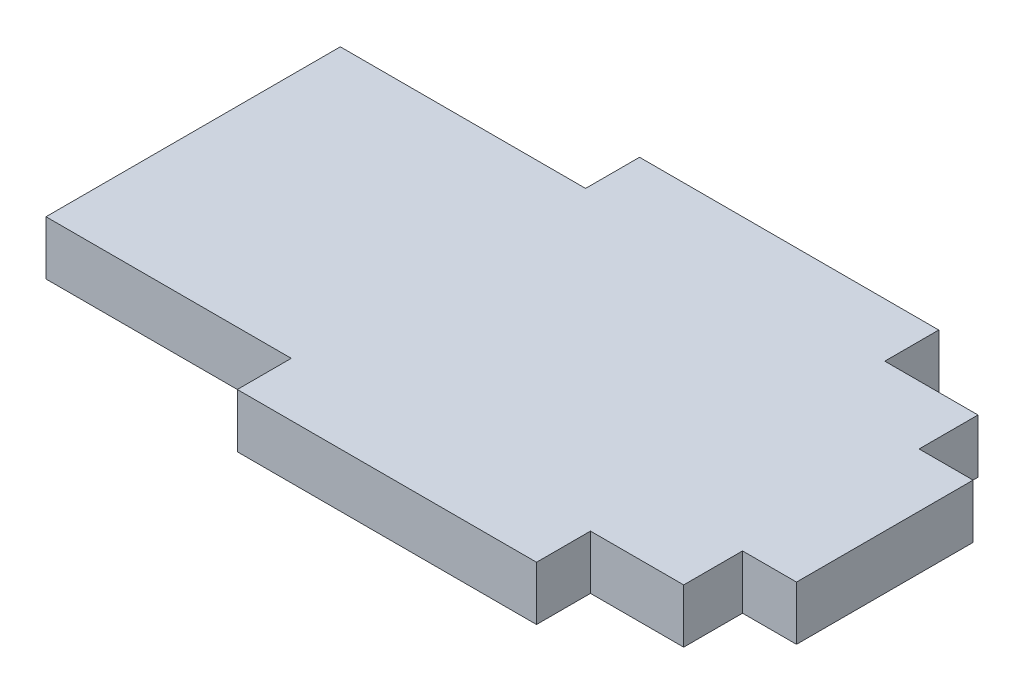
ISO-10303-21;
HEADER;
FILE_DESCRIPTION(('STEP AP214'),'2;1');
FILE_NAME('part.step','',(''),(''),'','','');
FILE_SCHEMA(('AUTOMOTIVE_DESIGN { 1 0 10303 214 1 1 1 1 }'));
ENDSEC;
DATA;
#1=APPLICATION_CONTEXT('core data for automotive mechanical design processes');
#2=APPLICATION_PROTOCOL_DEFINITION('international standard','automotive_design',2000,#1);
#3=PRODUCT_CONTEXT('',#1,'mechanical');
#4=PRODUCT('Part','Part','',(#3));
#5=PRODUCT_RELATED_PRODUCT_CATEGORY('part','',(#4));
#6=PRODUCT_DEFINITION_FORMATION('','',#4);
#7=PRODUCT_DEFINITION_CONTEXT('part definition',#1,'design');
#8=PRODUCT_DEFINITION('design','',#6,#7);
#9=PRODUCT_DEFINITION_SHAPE('','',#8);
#10=(LENGTH_UNIT() NAMED_UNIT(*) SI_UNIT(.MILLI.,.METRE.));
#11=(NAMED_UNIT(*) PLANE_ANGLE_UNIT() SI_UNIT($,.RADIAN.));
#12=(NAMED_UNIT(*) SI_UNIT($,.STERADIAN.) SOLID_ANGLE_UNIT());
#13=UNCERTAINTY_MEASURE_WITH_UNIT(LENGTH_MEASURE(1.E-05),#10,'distance_accuracy_value','');
#14=(GEOMETRIC_REPRESENTATION_CONTEXT(3) GLOBAL_UNCERTAINTY_ASSIGNED_CONTEXT((#13)) GLOBAL_UNIT_ASSIGNED_CONTEXT((#10,
#11,#12)) REPRESENTATION_CONTEXT('',''));
#15=CARTESIAN_POINT('',(0.,0.,0.));
#16=DIRECTION('',(0.,0.,1.));
#17=DIRECTION('',(1.,0.,0.));
#18=AXIS2_PLACEMENT_3D('',#15,#16,#17);
#19=CARTESIAN_POINT('',(-7.5,5.5,15.));
#20=DIRECTION('',(0.,0.,-1.));
#21=DIRECTION('',(-1.,0.,0.));
#22=AXIS2_PLACEMENT_3D('',#19,#20,#21);
#23=PLANE('',#22);
#24=DIRECTION('',(1.,0.,0.));
#25=VECTOR('',#24,1.);
#26=CARTESIAN_POINT('',(-7.5,0.,15.));
#27=LINE('',#26,#25);
#28=CARTESIAN_POINT('',(-32.5,0.,15.));
#29=VERTEX_POINT('',#28);
#30=CARTESIAN_POINT('',(-7.5,0.,15.));
#31=VERTEX_POINT('',#30);
#32=EDGE_CURVE('E192',#29,#31,#27,.T.);
#33=ORIENTED_EDGE('',*,*,#32,.T.);
#34=DIRECTION('',(0.,-1.,0.));
#35=VECTOR('',#34,1.);
#36=CARTESIAN_POINT('',(-7.5,5.5,15.));
#37=LINE('',#36,#35);
#38=CARTESIAN_POINT('',(-7.5,5.5,15.));
#39=VERTEX_POINT('',#38);
#40=EDGE_CURVE('E11',#39,#31,#37,.T.);
#41=ORIENTED_EDGE('',*,*,#40,.F.);
#42=DIRECTION('',(1.,0.,0.));
#43=VECTOR('',#42,1.);
#44=CARTESIAN_POINT('',(-7.5,5.5,15.));
#45=LINE('',#44,#43);
#46=CARTESIAN_POINT('',(-32.5,5.5,15.));
#47=VERTEX_POINT('',#46);
#48=EDGE_CURVE('E238',#47,#39,#45,.T.);
#49=ORIENTED_EDGE('',*,*,#48,.F.);
#50=DIRECTION('',(0.,-1.,0.));
#51=VECTOR('',#50,1.);
#52=CARTESIAN_POINT('',(-32.5,5.5,15.));
#53=LINE('',#52,#51);
#54=EDGE_CURVE('E188',#47,#29,#53,.T.);
#55=ORIENTED_EDGE('',*,*,#54,.T.);
#56=EDGE_LOOP('',(#33,#41,#49,#55));
#57=FACE_BOUND('',#56,.T.);
#58=ADVANCED_FACE('F43',(#57),#23,.F.);
#59=CARTESIAN_POINT('',(-7.5,5.5,15.));
#60=DIRECTION('',(1.,0.,0.));
#61=DIRECTION('',(0.,0.,-1.));
#62=AXIS2_PLACEMENT_3D('',#59,#60,#61);
#63=PLANE('',#62);
#64=DIRECTION('',(0.,0.,1.));
#65=VECTOR('',#64,1.);
#66=CARTESIAN_POINT('',(-7.5,0.,15.));
#67=LINE('',#66,#65);
#68=CARTESIAN_POINT('',(-7.5,0.,20.5));
#69=VERTEX_POINT('',#68);
#70=EDGE_CURVE('E196',#31,#69,#67,.T.);
#71=ORIENTED_EDGE('',*,*,#70,.T.);
#72=DIRECTION('',(0.,-1.,0.));
#73=VECTOR('',#72,1.);
#74=CARTESIAN_POINT('',(-7.5,5.5,20.5));
#75=LINE('',#74,#73);
#76=CARTESIAN_POINT('',(-7.5,5.5,20.5));
#77=VERTEX_POINT('',#76);
#78=EDGE_CURVE('E52',#77,#69,#75,.T.);
#79=ORIENTED_EDGE('',*,*,#78,.F.);
#80=DIRECTION('',(0.,0.,1.));
#81=VECTOR('',#80,1.);
#82=CARTESIAN_POINT('',(-7.5,5.5,15.));
#83=LINE('',#82,#81);
#84=EDGE_CURVE('E127',#39,#77,#83,.T.);
#85=ORIENTED_EDGE('',*,*,#84,.F.);
#86=ORIENTED_EDGE('',*,*,#40,.T.);
#87=EDGE_LOOP('',(#71,#79,#85,#86));
#88=FACE_BOUND('',#87,.T.);
#89=ADVANCED_FACE('F360',(#88),#63,.F.);
#90=CARTESIAN_POINT('',(-7.5,5.5,20.5));
#91=DIRECTION('',(0.,0.,-1.));
#92=DIRECTION('',(-1.,0.,0.));
#93=AXIS2_PLACEMENT_3D('',#90,#91,#92);
#94=PLANE('',#93);
#95=DIRECTION('',(1.,0.,0.));
#96=VECTOR('',#95,1.);
#97=CARTESIAN_POINT('',(-7.5,0.,20.5));
#98=LINE('',#97,#96);
#99=CARTESIAN_POINT('',(23.,0.,20.5));
#100=VERTEX_POINT('',#99);
#101=EDGE_CURVE('E199',#69,#100,#98,.T.);
#102=ORIENTED_EDGE('',*,*,#101,.T.);
#103=DIRECTION('',(0.,-1.,0.));
#104=VECTOR('',#103,1.);
#105=CARTESIAN_POINT('',(23.,5.5,20.5));
#106=LINE('',#105,#104);
#107=CARTESIAN_POINT('',(23.,5.5,20.5));
#108=VERTEX_POINT('',#107);
#109=EDGE_CURVE('E281',#108,#100,#106,.T.);
#110=ORIENTED_EDGE('',*,*,#109,.F.);
#111=DIRECTION('',(1.,0.,0.));
#112=VECTOR('',#111,1.);
#113=CARTESIAN_POINT('',(-7.5,5.5,20.5));
#114=LINE('',#113,#112);
#115=EDGE_CURVE('E291',#77,#108,#114,.T.);
#116=ORIENTED_EDGE('',*,*,#115,.F.);
#117=ORIENTED_EDGE('',*,*,#78,.T.);
#118=EDGE_LOOP('',(#102,#110,#116,#117));
#119=FACE_BOUND('',#118,.T.);
#120=ADVANCED_FACE('F289',(#119),#94,.F.);
#121=CARTESIAN_POINT('',(23.,5.5,20.5));
#122=DIRECTION('',(-1.,0.,0.));
#123=DIRECTION('',(0.,0.,1.));
#124=AXIS2_PLACEMENT_3D('',#121,#122,#123);
#125=PLANE('',#124);
#126=DIRECTION('',(0.,0.,-1.));
#127=VECTOR('',#126,1.);
#128=CARTESIAN_POINT('',(23.,0.,20.5));
#129=LINE('',#128,#127);
#130=CARTESIAN_POINT('',(23.,0.,15.));
#131=VERTEX_POINT('',#130);
#132=EDGE_CURVE('E202',#100,#131,#129,.T.);
#133=ORIENTED_EDGE('',*,*,#132,.T.);
#134=DIRECTION('',(0.,-1.,0.));
#135=VECTOR('',#134,1.);
#136=CARTESIAN_POINT('',(23.,5.5,15.));
#137=LINE('',#136,#135);
#138=CARTESIAN_POINT('',(23.,5.5,15.));
#139=VERTEX_POINT('',#138);
#140=EDGE_CURVE('E277',#139,#131,#137,.T.);
#141=ORIENTED_EDGE('',*,*,#140,.F.);
#142=DIRECTION('',(0.,0.,-1.));
#143=VECTOR('',#142,1.);
#144=CARTESIAN_POINT('',(23.,5.5,20.5));
#145=LINE('',#144,#143);
#146=EDGE_CURVE('E310',#108,#139,#145,.T.);
#147=ORIENTED_EDGE('',*,*,#146,.F.);
#148=ORIENTED_EDGE('',*,*,#109,.T.);
#149=EDGE_LOOP('',(#133,#141,#147,#148));
#150=FACE_BOUND('',#149,.T.);
#151=ADVANCED_FACE('F300',(#150),#125,.F.);
#152=CARTESIAN_POINT('',(32.5,5.5,15.));
#153=DIRECTION('',(0.,0.,-1.));
#154=DIRECTION('',(-1.,0.,0.));
#155=AXIS2_PLACEMENT_3D('',#152,#153,#154);
#156=PLANE('',#155);
#157=DIRECTION('',(1.,0.,0.));
#158=VECTOR('',#157,1.);
#159=CARTESIAN_POINT('',(32.5,0.,15.));
#160=LINE('',#159,#158);
#161=CARTESIAN_POINT('',(32.5,0.,15.));
#162=VERTEX_POINT('',#161);
#163=EDGE_CURVE('E205',#131,#162,#160,.T.);
#164=ORIENTED_EDGE('',*,*,#163,.T.);
#165=DIRECTION('',(0.,-1.,0.));
#166=VECTOR('',#165,1.);
#167=CARTESIAN_POINT('',(32.5,5.5,15.));
#168=LINE('',#167,#166);
#169=CARTESIAN_POINT('',(32.5,5.5,15.));
#170=VERTEX_POINT('',#169);
#171=EDGE_CURVE('E273',#170,#162,#168,.T.);
#172=ORIENTED_EDGE('',*,*,#171,.F.);
#173=DIRECTION('',(1.,0.,0.));
#174=VECTOR('',#173,1.);
#175=CARTESIAN_POINT('',(32.5,5.5,15.));
#176=LINE('',#175,#174);
#177=EDGE_CURVE('E306',#139,#170,#176,.T.);
#178=ORIENTED_EDGE('',*,*,#177,.F.);
#179=ORIENTED_EDGE('',*,*,#140,.T.);
#180=EDGE_LOOP('',(#164,#172,#178,#179));
#181=FACE_BOUND('',#180,.T.);
#182=ADVANCED_FACE('F304',(#181),#156,.F.);
#183=CARTESIAN_POINT('',(32.5,5.5,8.99999999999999));
#184=DIRECTION('',(-1.,0.,0.));
#185=DIRECTION('',(0.,0.,1.));
#186=AXIS2_PLACEMENT_3D('',#183,#184,#185);
#187=PLANE('',#186);
#188=DIRECTION('',(0.,0.,-1.));
#189=VECTOR('',#188,1.);
#190=CARTESIAN_POINT('',(32.5,0.,8.99999999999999));
#191=LINE('',#190,#189);
#192=CARTESIAN_POINT('',(32.5,0.,8.99999999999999));
#193=VERTEX_POINT('',#192);
#194=EDGE_CURVE('E208',#162,#193,#191,.T.);
#195=ORIENTED_EDGE('',*,*,#194,.T.);
#196=DIRECTION('',(0.,-1.,0.));
#197=VECTOR('',#196,1.);
#198=CARTESIAN_POINT('',(32.5,5.5,8.99999999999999));
#199=LINE('',#198,#197);
#200=CARTESIAN_POINT('',(32.5,5.5,8.99999999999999));
#201=VERTEX_POINT('',#200);
#202=EDGE_CURVE('E269',#201,#193,#199,.T.);
#203=ORIENTED_EDGE('',*,*,#202,.F.);
#204=DIRECTION('',(0.,0.,-1.));
#205=VECTOR('',#204,1.);
#206=CARTESIAN_POINT('',(32.5,5.5,8.99999999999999));
#207=LINE('',#206,#205);
#208=EDGE_CURVE('E309',#170,#201,#207,.T.);
#209=ORIENTED_EDGE('',*,*,#208,.F.);
#210=ORIENTED_EDGE('',*,*,#171,.T.);
#211=EDGE_LOOP('',(#195,#203,#209,#210));
#212=FACE_BOUND('',#211,.T.);
#213=ADVANCED_FACE('F373',(#212),#187,.F.);
#214=CARTESIAN_POINT('',(38.,5.5,8.99999999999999));
#215=DIRECTION('',(0.,0.,-1.));
#216=DIRECTION('',(-1.,0.,0.));
#217=AXIS2_PLACEMENT_3D('',#214,#215,#216);
#218=PLANE('',#217);
#219=DIRECTION('',(1.,0.,0.));
#220=VECTOR('',#219,1.);
#221=CARTESIAN_POINT('',(38.,0.,8.99999999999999));
#222=LINE('',#221,#220);
#223=CARTESIAN_POINT('',(38.,0.,8.99999999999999));
#224=VERTEX_POINT('',#223);
#225=EDGE_CURVE('E211',#193,#224,#222,.T.);
#226=ORIENTED_EDGE('',*,*,#225,.T.);
#227=DIRECTION('',(0.,-1.,0.));
#228=VECTOR('',#227,1.);
#229=CARTESIAN_POINT('',(38.,5.5,8.99999999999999));
#230=LINE('',#229,#228);
#231=CARTESIAN_POINT('',(38.,5.5,8.99999999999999));
#232=VERTEX_POINT('',#231);
#233=EDGE_CURVE('E265',#232,#224,#230,.T.);
#234=ORIENTED_EDGE('',*,*,#233,.F.);
#235=DIRECTION('',(1.,0.,0.));
#236=VECTOR('',#235,1.);
#237=CARTESIAN_POINT('',(38.,5.5,8.99999999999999));
#238=LINE('',#237,#236);
#239=EDGE_CURVE('E314',#201,#232,#238,.T.);
#240=ORIENTED_EDGE('',*,*,#239,.F.);
#241=ORIENTED_EDGE('',*,*,#202,.T.);
#242=EDGE_LOOP('',(#226,#234,#240,#241));
#243=FACE_BOUND('',#242,.T.);
#244=ADVANCED_FACE('F376',(#243),#218,.F.);
#245=CARTESIAN_POINT('',(38.,5.5,-9.00000000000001));
#246=DIRECTION('',(-1.,0.,0.));
#247=DIRECTION('',(0.,0.,1.));
#248=AXIS2_PLACEMENT_3D('',#245,#246,#247);
#249=PLANE('',#248);
#250=DIRECTION('',(0.,0.,-1.));
#251=VECTOR('',#250,1.);
#252=CARTESIAN_POINT('',(38.,0.,-9.00000000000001));
#253=LINE('',#252,#251);
#254=CARTESIAN_POINT('',(38.,0.,-9.00000000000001));
#255=VERTEX_POINT('',#254);
#256=EDGE_CURVE('E214',#224,#255,#253,.T.);
#257=ORIENTED_EDGE('',*,*,#256,.T.);
#258=DIRECTION('',(0.,-1.,0.));
#259=VECTOR('',#258,1.);
#260=CARTESIAN_POINT('',(38.,5.5,-9.00000000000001));
#261=LINE('',#260,#259);
#262=CARTESIAN_POINT('',(38.,5.5,-9.00000000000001));
#263=VERTEX_POINT('',#262);
#264=EDGE_CURVE('E261',#263,#255,#261,.T.);
#265=ORIENTED_EDGE('',*,*,#264,.F.);
#266=DIRECTION('',(0.,0.,-1.));
#267=VECTOR('',#266,1.);
#268=CARTESIAN_POINT('',(38.,5.5,-9.00000000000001));
#269=LINE('',#268,#267);
#270=EDGE_CURVE('E321',#232,#263,#269,.T.);
#271=ORIENTED_EDGE('',*,*,#270,.F.);
#272=ORIENTED_EDGE('',*,*,#233,.T.);
#273=EDGE_LOOP('',(#257,#265,#271,#272));
#274=FACE_BOUND('',#273,.T.);
#275=ADVANCED_FACE('F380',(#274),#249,.F.);
#276=CARTESIAN_POINT('',(32.5,5.5,-9.00000000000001));
#277=DIRECTION('',(0.,0.,1.));
#278=DIRECTION('',(1.,0.,0.));
#279=AXIS2_PLACEMENT_3D('',#276,#277,#278);
#280=PLANE('',#279);
#281=DIRECTION('',(-1.,0.,0.));
#282=VECTOR('',#281,1.);
#283=CARTESIAN_POINT('',(32.5,0.,-9.00000000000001));
#284=LINE('',#283,#282);
#285=CARTESIAN_POINT('',(32.5,0.,-9.00000000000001));
#286=VERTEX_POINT('',#285);
#287=EDGE_CURVE('E217',#255,#286,#284,.T.);
#288=ORIENTED_EDGE('',*,*,#287,.T.);
#289=DIRECTION('',(0.,-1.,0.));
#290=VECTOR('',#289,1.);
#291=CARTESIAN_POINT('',(32.5,5.5,-9.00000000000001));
#292=LINE('',#291,#290);
#293=CARTESIAN_POINT('',(32.5,5.5,-9.00000000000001));
#294=VERTEX_POINT('',#293);
#295=EDGE_CURVE('E257',#294,#286,#292,.T.);
#296=ORIENTED_EDGE('',*,*,#295,.F.);
#297=DIRECTION('',(-1.,0.,0.));
#298=VECTOR('',#297,1.);
#299=CARTESIAN_POINT('',(32.5,5.5,-9.00000000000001));
#300=LINE('',#299,#298);
#301=EDGE_CURVE('E324',#263,#294,#300,.T.);
#302=ORIENTED_EDGE('',*,*,#301,.F.);
#303=ORIENTED_EDGE('',*,*,#264,.T.);
#304=EDGE_LOOP('',(#288,#296,#302,#303));
#305=FACE_BOUND('',#304,.T.);
#306=ADVANCED_FACE('F384',(#305),#280,.F.);
#307=CARTESIAN_POINT('',(32.5,5.5,-15.));
#308=DIRECTION('',(-1.,0.,0.));
#309=DIRECTION('',(0.,0.,1.));
#310=AXIS2_PLACEMENT_3D('',#307,#308,#309);
#311=PLANE('',#310);
#312=DIRECTION('',(0.,0.,-1.));
#313=VECTOR('',#312,1.);
#314=CARTESIAN_POINT('',(32.5,0.,-15.));
#315=LINE('',#314,#313);
#316=CARTESIAN_POINT('',(32.5,0.,-15.));
#317=VERTEX_POINT('',#316);
#318=EDGE_CURVE('E220',#286,#317,#315,.T.);
#319=ORIENTED_EDGE('',*,*,#318,.T.);
#320=DIRECTION('',(0.,-1.,0.));
#321=VECTOR('',#320,1.);
#322=CARTESIAN_POINT('',(32.5,5.5,-15.));
#323=LINE('',#322,#321);
#324=CARTESIAN_POINT('',(32.5,5.5,-15.));
#325=VERTEX_POINT('',#324);
#326=EDGE_CURVE('E253',#325,#317,#323,.T.);
#327=ORIENTED_EDGE('',*,*,#326,.F.);
#328=DIRECTION('',(0.,0.,-1.));
#329=VECTOR('',#328,1.);
#330=CARTESIAN_POINT('',(32.5,5.5,-15.));
#331=LINE('',#330,#329);
#332=EDGE_CURVE('E327',#294,#325,#331,.T.);
#333=ORIENTED_EDGE('',*,*,#332,.F.);
#334=ORIENTED_EDGE('',*,*,#295,.T.);
#335=EDGE_LOOP('',(#319,#327,#333,#334));
#336=FACE_BOUND('',#335,.T.);
#337=ADVANCED_FACE('F388',(#336),#311,.F.);
#338=CARTESIAN_POINT('',(32.5,5.5,-15.));
#339=DIRECTION('',(0.,0.,1.));
#340=DIRECTION('',(1.,0.,0.));
#341=AXIS2_PLACEMENT_3D('',#338,#339,#340);
#342=PLANE('',#341);
#343=DIRECTION('',(-1.,0.,0.));
#344=VECTOR('',#343,1.);
#345=CARTESIAN_POINT('',(32.5,0.,-15.));
#346=LINE('',#345,#344);
#347=CARTESIAN_POINT('',(23.,0.,-15.));
#348=VERTEX_POINT('',#347);
#349=EDGE_CURVE('E223',#317,#348,#346,.T.);
#350=ORIENTED_EDGE('',*,*,#349,.T.);
#351=DIRECTION('',(0.,-1.,0.));
#352=VECTOR('',#351,1.);
#353=CARTESIAN_POINT('',(23.,5.5,-15.));
#354=LINE('',#353,#352);
#355=CARTESIAN_POINT('',(23.,5.5,-15.));
#356=VERTEX_POINT('',#355);
#357=EDGE_CURVE('E249',#356,#348,#354,.T.);
#358=ORIENTED_EDGE('',*,*,#357,.F.);
#359=DIRECTION('',(-1.,0.,0.));
#360=VECTOR('',#359,1.);
#361=CARTESIAN_POINT('',(32.5,5.5,-15.));
#362=LINE('',#361,#360);
#363=EDGE_CURVE('E330',#325,#356,#362,.T.);
#364=ORIENTED_EDGE('',*,*,#363,.F.);
#365=ORIENTED_EDGE('',*,*,#326,.T.);
#366=EDGE_LOOP('',(#350,#358,#364,#365));
#367=FACE_BOUND('',#366,.T.);
#368=ADVANCED_FACE('F392',(#367),#342,.F.);
#369=CARTESIAN_POINT('',(23.,5.5,-20.5));
#370=DIRECTION('',(-1.,0.,0.));
#371=DIRECTION('',(0.,0.,1.));
#372=AXIS2_PLACEMENT_3D('',#369,#370,#371);
#373=PLANE('',#372);
#374=DIRECTION('',(0.,0.,-1.));
#375=VECTOR('',#374,1.);
#376=CARTESIAN_POINT('',(23.,0.,-20.5));
#377=LINE('',#376,#375);
#378=CARTESIAN_POINT('',(23.,0.,-20.5));
#379=VERTEX_POINT('',#378);
#380=EDGE_CURVE('E226',#348,#379,#377,.T.);
#381=ORIENTED_EDGE('',*,*,#380,.T.);
#382=DIRECTION('',(0.,-1.,0.));
#383=VECTOR('',#382,1.);
#384=CARTESIAN_POINT('',(23.,5.5,-20.5));
#385=LINE('',#384,#383);
#386=CARTESIAN_POINT('',(23.,5.5,-20.5));
#387=VERTEX_POINT('',#386);
#388=EDGE_CURVE('E245',#387,#379,#385,.T.);
#389=ORIENTED_EDGE('',*,*,#388,.F.);
#390=DIRECTION('',(0.,0.,-1.));
#391=VECTOR('',#390,1.);
#392=CARTESIAN_POINT('',(23.,5.5,-20.5));
#393=LINE('',#392,#391);
#394=EDGE_CURVE('E333',#356,#387,#393,.T.);
#395=ORIENTED_EDGE('',*,*,#394,.F.);
#396=ORIENTED_EDGE('',*,*,#357,.T.);
#397=EDGE_LOOP('',(#381,#389,#395,#396));
#398=FACE_BOUND('',#397,.T.);
#399=ADVANCED_FACE('F341',(#398),#373,.F.);
#400=CARTESIAN_POINT('',(-7.5,5.5,-20.5));
#401=DIRECTION('',(0.,0.,1.));
#402=DIRECTION('',(1.,0.,0.));
#403=AXIS2_PLACEMENT_3D('',#400,#401,#402);
#404=PLANE('',#403);
#405=DIRECTION('',(-1.,0.,0.));
#406=VECTOR('',#405,1.);
#407=CARTESIAN_POINT('',(-7.5,0.,-20.5));
#408=LINE('',#407,#406);
#409=CARTESIAN_POINT('',(-7.5,0.,-20.5));
#410=VERTEX_POINT('',#409);
#411=EDGE_CURVE('E229',#379,#410,#408,.T.);
#412=ORIENTED_EDGE('',*,*,#411,.T.);
#413=DIRECTION('',(0.,-1.,0.));
#414=VECTOR('',#413,1.);
#415=CARTESIAN_POINT('',(-7.5,5.5,-20.5));
#416=LINE('',#415,#414);
#417=CARTESIAN_POINT('',(-7.5,5.5,-20.5));
#418=VERTEX_POINT('',#417);
#419=EDGE_CURVE('E181',#418,#410,#416,.T.);
#420=ORIENTED_EDGE('',*,*,#419,.F.);
#421=DIRECTION('',(-1.,0.,0.));
#422=VECTOR('',#421,1.);
#423=CARTESIAN_POINT('',(-7.5,5.5,-20.5));
#424=LINE('',#423,#422);
#425=EDGE_CURVE('E170',#387,#418,#424,.T.);
#426=ORIENTED_EDGE('',*,*,#425,.F.);
#427=ORIENTED_EDGE('',*,*,#388,.T.);
#428=EDGE_LOOP('',(#412,#420,#426,#427));
#429=FACE_BOUND('',#428,.T.);
#430=ADVANCED_FACE('F345',(#429),#404,.F.);
#431=CARTESIAN_POINT('',(-7.5,5.5,-15.));
#432=DIRECTION('',(1.,0.,0.));
#433=DIRECTION('',(0.,0.,-1.));
#434=AXIS2_PLACEMENT_3D('',#431,#432,#433);
#435=PLANE('',#434);
#436=DIRECTION('',(0.,0.,1.));
#437=VECTOR('',#436,1.);
#438=CARTESIAN_POINT('',(-7.5,0.,-15.));
#439=LINE('',#438,#437);
#440=CARTESIAN_POINT('',(-7.5,0.,-15.));
#441=VERTEX_POINT('',#440);
#442=EDGE_CURVE('E179',#410,#441,#439,.T.);
#443=ORIENTED_EDGE('',*,*,#442,.T.);
#444=DIRECTION('',(0.,-1.,0.));
#445=VECTOR('',#444,1.);
#446=CARTESIAN_POINT('',(-7.5,5.5,-15.));
#447=LINE('',#446,#445);
#448=CARTESIAN_POINT('',(-7.5,5.5,-15.));
#449=VERTEX_POINT('',#448);
#450=EDGE_CURVE('E176',#449,#441,#447,.T.);
#451=ORIENTED_EDGE('',*,*,#450,.F.);
#452=DIRECTION('',(0.,0.,1.));
#453=VECTOR('',#452,1.);
#454=CARTESIAN_POINT('',(-7.5,5.5,-15.));
#455=LINE('',#454,#453);
#456=EDGE_CURVE('E164',#418,#449,#455,.T.);
#457=ORIENTED_EDGE('',*,*,#456,.F.);
#458=ORIENTED_EDGE('',*,*,#419,.T.);
#459=EDGE_LOOP('',(#443,#451,#457,#458));
#460=FACE_BOUND('',#459,.T.);
#461=ADVANCED_FACE('F177',(#460),#435,.F.);
#462=CARTESIAN_POINT('',(-7.5,5.5,-15.));
#463=DIRECTION('',(0.,0.,1.));
#464=DIRECTION('',(1.,0.,0.));
#465=AXIS2_PLACEMENT_3D('',#462,#463,#464);
#466=PLANE('',#465);
#467=DIRECTION('',(-1.,0.,0.));
#468=VECTOR('',#467,1.);
#469=CARTESIAN_POINT('',(-7.5,0.,-15.));
#470=LINE('',#469,#468);
#471=CARTESIAN_POINT('',(-32.5,0.,-15.));
#472=VERTEX_POINT('',#471);
#473=EDGE_CURVE('E113',#441,#472,#470,.T.);
#474=ORIENTED_EDGE('',*,*,#473,.T.);
#475=DIRECTION('',(0.,-1.,0.));
#476=VECTOR('',#475,1.);
#477=CARTESIAN_POINT('',(-32.5,5.5,-15.));
#478=LINE('',#477,#476);
#479=CARTESIAN_POINT('',(-32.5,5.5,-15.));
#480=VERTEX_POINT('',#479);
#481=EDGE_CURVE('E182',#480,#472,#478,.T.);
#482=ORIENTED_EDGE('',*,*,#481,.F.);
#483=DIRECTION('',(-1.,0.,0.));
#484=VECTOR('',#483,1.);
#485=CARTESIAN_POINT('',(-7.5,5.5,-15.));
#486=LINE('',#485,#484);
#487=EDGE_CURVE('E168',#449,#480,#486,.T.);
#488=ORIENTED_EDGE('',*,*,#487,.F.);
#489=ORIENTED_EDGE('',*,*,#450,.T.);
#490=EDGE_LOOP('',(#474,#482,#488,#489));
#491=FACE_BOUND('',#490,.T.);
#492=ADVANCED_FACE('F184',(#491),#466,.F.);
#493=CARTESIAN_POINT('',(-32.5,5.5,-15.));
#494=DIRECTION('',(1.,0.,0.));
#495=DIRECTION('',(0.,0.,-1.));
#496=AXIS2_PLACEMENT_3D('',#493,#494,#495);
#497=PLANE('',#496);
#498=DIRECTION('',(0.,0.,1.));
#499=VECTOR('',#498,1.);
#500=CARTESIAN_POINT('',(-32.5,0.,-15.));
#501=LINE('',#500,#499);
#502=EDGE_CURVE('E119',#472,#29,#501,.T.);
#503=ORIENTED_EDGE('',*,*,#502,.T.);
#504=ORIENTED_EDGE('',*,*,#54,.F.);
#505=DIRECTION('',(0.,0.,1.));
#506=VECTOR('',#505,1.);
#507=CARTESIAN_POINT('',(-32.5,5.5,-15.));
#508=LINE('',#507,#506);
#509=EDGE_CURVE('E60',#480,#47,#508,.T.);
#510=ORIENTED_EDGE('',*,*,#509,.F.);
#511=ORIENTED_EDGE('',*,*,#481,.T.);
#512=EDGE_LOOP('',(#503,#504,#510,#511));
#513=FACE_BOUND('',#512,.T.);
#514=ADVANCED_FACE('F349',(#513),#497,.F.);
#515=CARTESIAN_POINT('',(0.,5.5,0.));
#516=DIRECTION('',(0.,1.,0.));
#517=DIRECTION('',(0.,0.,1.));
#518=AXIS2_PLACEMENT_3D('',#515,#516,#517);
#519=PLANE('',#518);
#520=ORIENTED_EDGE('',*,*,#48,.T.);
#521=ORIENTED_EDGE('',*,*,#84,.T.);
#522=ORIENTED_EDGE('',*,*,#115,.T.);
#523=ORIENTED_EDGE('',*,*,#146,.T.);
#524=ORIENTED_EDGE('',*,*,#177,.T.);
#525=ORIENTED_EDGE('',*,*,#208,.T.);
#526=ORIENTED_EDGE('',*,*,#239,.T.);
#527=ORIENTED_EDGE('',*,*,#270,.T.);
#528=ORIENTED_EDGE('',*,*,#301,.T.);
#529=ORIENTED_EDGE('',*,*,#332,.T.);
#530=ORIENTED_EDGE('',*,*,#363,.T.);
#531=ORIENTED_EDGE('',*,*,#394,.T.);
#532=ORIENTED_EDGE('',*,*,#425,.T.);
#533=ORIENTED_EDGE('',*,*,#456,.T.);
#534=ORIENTED_EDGE('',*,*,#487,.T.);
#535=ORIENTED_EDGE('',*,*,#509,.T.);
#536=EDGE_LOOP('',(#520,#521,#522,#523,#524,#525,#526,#527,#528,#529,#530,#531,#532,#533,#534,#535));
#537=FACE_BOUND('',#536,.T.);
#538=ADVANCED_FACE('F166',(#537),#519,.T.);
#539=CARTESIAN_POINT('',(0.,0.,0.));
#540=DIRECTION('',(0.,1.,0.));
#541=DIRECTION('',(0.,0.,1.));
#542=AXIS2_PLACEMENT_3D('',#539,#540,#541);
#543=PLANE('',#542);
#544=ORIENTED_EDGE('',*,*,#32,.F.);
#545=ORIENTED_EDGE('',*,*,#502,.F.);
#546=ORIENTED_EDGE('',*,*,#473,.F.);
#547=ORIENTED_EDGE('',*,*,#442,.F.);
#548=ORIENTED_EDGE('',*,*,#411,.F.);
#549=ORIENTED_EDGE('',*,*,#380,.F.);
#550=ORIENTED_EDGE('',*,*,#349,.F.);
#551=ORIENTED_EDGE('',*,*,#318,.F.);
#552=ORIENTED_EDGE('',*,*,#287,.F.);
#553=ORIENTED_EDGE('',*,*,#256,.F.);
#554=ORIENTED_EDGE('',*,*,#225,.F.);
#555=ORIENTED_EDGE('',*,*,#194,.F.);
#556=ORIENTED_EDGE('',*,*,#163,.F.);
#557=ORIENTED_EDGE('',*,*,#132,.F.);
#558=ORIENTED_EDGE('',*,*,#101,.F.);
#559=ORIENTED_EDGE('',*,*,#70,.F.);
#560=EDGE_LOOP('',(#544,#545,#546,#547,#548,#549,#550,#551,#552,#553,#554,#555,#556,#557,#558,#559));
#561=FACE_BOUND('',#560,.T.);
#562=ADVANCED_FACE('F295',(#561),#543,.F.);
#563=CLOSED_SHELL('',(#58,#89,#120,#151,#182,#213,#244,#275,#306,#337,#368,#399,#430,#461,#492,
#514,#538,#562));
#564=MANIFOLD_SOLID_BREP('B2',#563);
#565=ADVANCED_BREP_SHAPE_REPRESENTATION('',(#18,#564),#14);
#566=SHAPE_DEFINITION_REPRESENTATION(#9,#565);
ENDSEC;
END-ISO-10303-21;
